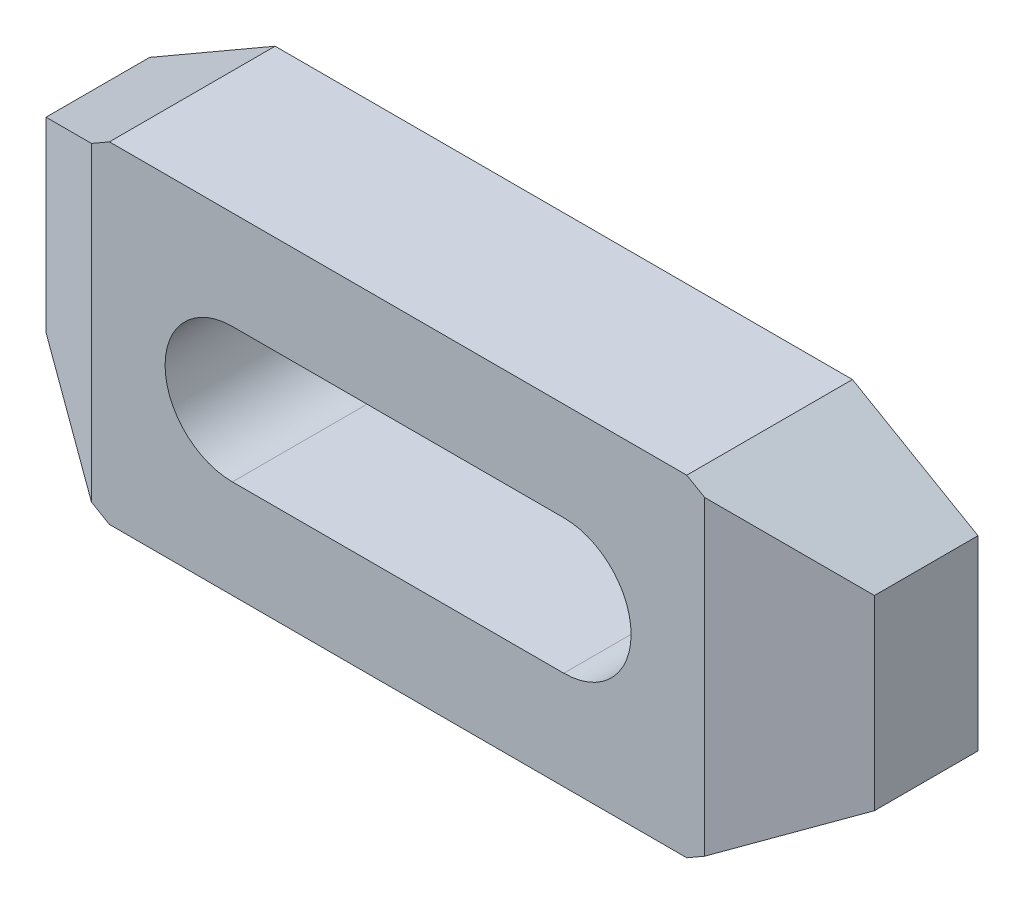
ISO-10303-21;
HEADER;
FILE_DESCRIPTION(('STEP AP214'),'2;1');
FILE_NAME('part.step','',(''),(''),'','','');
FILE_SCHEMA(('AUTOMOTIVE_DESIGN { 1 0 10303 214 1 1 1 1 }'));
ENDSEC;
DATA;
#1=APPLICATION_CONTEXT('core data for automotive mechanical design processes');
#2=APPLICATION_PROTOCOL_DEFINITION('international standard','automotive_design',2000,#1);
#3=PRODUCT_CONTEXT('',#1,'mechanical');
#4=PRODUCT('Part','Part','',(#3));
#5=PRODUCT_RELATED_PRODUCT_CATEGORY('part','',(#4));
#6=PRODUCT_DEFINITION_FORMATION('','',#4);
#7=PRODUCT_DEFINITION_CONTEXT('part definition',#1,'design');
#8=PRODUCT_DEFINITION('design','',#6,#7);
#9=PRODUCT_DEFINITION_SHAPE('','',#8);
#10=(LENGTH_UNIT() NAMED_UNIT(*) SI_UNIT(.MILLI.,.METRE.));
#11=(NAMED_UNIT(*) PLANE_ANGLE_UNIT() SI_UNIT($,.RADIAN.));
#12=(NAMED_UNIT(*) SI_UNIT($,.STERADIAN.) SOLID_ANGLE_UNIT());
#13=UNCERTAINTY_MEASURE_WITH_UNIT(LENGTH_MEASURE(1.E-05),#10,'distance_accuracy_value','');
#14=(GEOMETRIC_REPRESENTATION_CONTEXT(3) GLOBAL_UNCERTAINTY_ASSIGNED_CONTEXT((#13)) GLOBAL_UNIT_ASSIGNED_CONTEXT((#10,
#11,#12)) REPRESENTATION_CONTEXT('',''));
#15=CARTESIAN_POINT('',(0.,0.,0.));
#16=DIRECTION('',(0.,0.,1.));
#17=DIRECTION('',(1.,0.,0.));
#18=AXIS2_PLACEMENT_3D('',#15,#16,#17);
#19=CARTESIAN_POINT('',(0.,-32.0940107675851,16.));
#20=DIRECTION('',(0.,0.,-1.));
#21=DIRECTION('',(-1.,0.,0.));
#22=AXIS2_PLACEMENT_3D('',#19,#20,#21);
#23=PLANE('',#22);
#24=CARTESIAN_POINT('',(16.,0.,16.));
#25=DIRECTION('',(0.,0.,1.));
#26=DIRECTION('',(1.,0.,0.));
#27=AXIS2_PLACEMENT_3D('',#24,#25,#26);
#28=CIRCLE('',#27,6.5);
#29=CARTESIAN_POINT('',(16.,-6.5,16.));
#30=VERTEX_POINT('',#29);
#31=CARTESIAN_POINT('',(16.,6.5,16.));
#32=VERTEX_POINT('',#31);
#33=EDGE_CURVE('E221',#30,#32,#28,.T.);
#34=ORIENTED_EDGE('',*,*,#33,.F.);
#35=DIRECTION('',(-1.,0.,0.));
#36=VECTOR('',#35,1.);
#37=CARTESIAN_POINT('',(16.,-6.5,16.));
#38=LINE('',#37,#36);
#39=CARTESIAN_POINT('',(-16.,-6.5,16.));
#40=VERTEX_POINT('',#39);
#41=EDGE_CURVE('E220',#30,#40,#38,.T.);
#42=ORIENTED_EDGE('',*,*,#41,.T.);
#43=CARTESIAN_POINT('',(-16.,0.,16.));
#44=DIRECTION('',(0.,0.,1.));
#45=DIRECTION('',(1.,0.,0.));
#46=AXIS2_PLACEMENT_3D('',#43,#44,#45);
#47=CIRCLE('',#46,6.5);
#48=CARTESIAN_POINT('',(-16.,6.5,16.));
#49=VERTEX_POINT('',#48);
#50=EDGE_CURVE('E228',#49,#40,#47,.T.);
#51=ORIENTED_EDGE('',*,*,#50,.F.);
#52=DIRECTION('',(-1.,0.,0.));
#53=VECTOR('',#52,1.);
#54=CARTESIAN_POINT('',(16.,6.5,16.));
#55=LINE('',#54,#53);
#56=EDGE_CURVE('E224',#32,#49,#55,.T.);
#57=ORIENTED_EDGE('',*,*,#56,.F.);
#58=EDGE_LOOP('',(#34,#42,#51,#57));
#59=FACE_BOUND('',#58,.T.);
#60=DIRECTION('',(0.,1.,0.));
#61=VECTOR('',#60,1.);
#62=CARTESIAN_POINT('',(-29.6076951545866,-32.0940107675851,16.));
#63=LINE('',#62,#61);
#64=CARTESIAN_POINT('',(-29.6076951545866,-15.,16.));
#65=VERTEX_POINT('',#64);
#66=CARTESIAN_POINT('',(-29.6076951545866,15.,16.));
#67=VERTEX_POINT('',#66);
#68=EDGE_CURVE('E115',#65,#67,#63,.T.);
#69=ORIENTED_EDGE('',*,*,#68,.F.);
#70=DIRECTION('',(-0.866025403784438,0.5,0.));
#71=VECTOR('',#70,1.);
#72=CARTESIAN_POINT('',(-27.8756443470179,-16.,16.));
#73=LINE('',#72,#71);
#74=CARTESIAN_POINT('',(-27.8756443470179,-16.,16.));
#75=VERTEX_POINT('',#74);
#76=EDGE_CURVE('E174',#75,#65,#73,.T.);
#77=ORIENTED_EDGE('',*,*,#76,.F.);
#78=DIRECTION('',(-1.,0.,0.));
#79=VECTOR('',#78,1.);
#80=CARTESIAN_POINT('',(27.8756443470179,-16.,16.));
#81=LINE('',#80,#79);
#82=CARTESIAN_POINT('',(27.8756443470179,-16.,16.));
#83=VERTEX_POINT('',#82);
#84=EDGE_CURVE('E177',#83,#75,#81,.T.);
#85=ORIENTED_EDGE('',*,*,#84,.F.);
#86=DIRECTION('',(-0.866025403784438,-0.5,0.));
#87=VECTOR('',#86,1.);
#88=CARTESIAN_POINT('',(40.,-9.,16.));
#89=LINE('',#88,#87);
#90=CARTESIAN_POINT('',(29.6076951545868,-15.,16.));
#91=VERTEX_POINT('',#90);
#92=EDGE_CURVE('E157',#91,#83,#89,.T.);
#93=ORIENTED_EDGE('',*,*,#92,.F.);
#94=DIRECTION('',(0.,1.,0.));
#95=VECTOR('',#94,1.);
#96=CARTESIAN_POINT('',(29.6076951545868,-32.0940107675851,16.));
#97=LINE('',#96,#95);
#98=CARTESIAN_POINT('',(29.6076951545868,15.,16.));
#99=VERTEX_POINT('',#98);
#100=EDGE_CURVE('E146',#91,#99,#97,.T.);
#101=ORIENTED_EDGE('',*,*,#100,.T.);
#102=DIRECTION('',(0.866025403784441,-0.5,0.));
#103=VECTOR('',#102,1.);
#104=CARTESIAN_POINT('',(27.8756443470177,16.,16.));
#105=LINE('',#104,#103);
#106=CARTESIAN_POINT('',(27.8756443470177,16.,16.));
#107=VERTEX_POINT('',#106);
#108=EDGE_CURVE('E155',#107,#99,#105,.T.);
#109=ORIENTED_EDGE('',*,*,#108,.F.);
#110=DIRECTION('',(1.,0.,0.));
#111=VECTOR('',#110,1.);
#112=CARTESIAN_POINT('',(-27.8756443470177,16.,16.));
#113=LINE('',#112,#111);
#114=CARTESIAN_POINT('',(-27.8756443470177,16.,16.));
#115=VERTEX_POINT('',#114);
#116=EDGE_CURVE('E164',#115,#107,#113,.T.);
#117=ORIENTED_EDGE('',*,*,#116,.F.);
#118=DIRECTION('',(0.866025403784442,0.5,0.));
#119=VECTOR('',#118,1.);
#120=CARTESIAN_POINT('',(-40.,9.,16.));
#121=LINE('',#120,#119);
#122=EDGE_CURVE('E167',#67,#115,#121,.T.);
#123=ORIENTED_EDGE('',*,*,#122,.F.);
#124=EDGE_LOOP('',(#69,#77,#85,#93,#101,#109,#117,#123));
#125=FACE_BOUND('',#124,.T.);
#126=ADVANCED_FACE('F14',(#59,#125),#23,.F.);
#127=CARTESIAN_POINT('',(-40.,9.,16.));
#128=DIRECTION('',(-0.5,0.866025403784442,0.));
#129=DIRECTION('',(-0.866025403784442,-0.5,0.));
#130=AXIS2_PLACEMENT_3D('',#127,#128,#129);
#131=PLANE('',#130);
#132=DIRECTION('',(0.,0.,-1.));
#133=VECTOR('',#132,1.);
#134=CARTESIAN_POINT('',(-40.,9.,16.));
#135=LINE('',#134,#133);
#136=CARTESIAN_POINT('',(-40.,9.,10.));
#137=VERTEX_POINT('',#136);
#138=CARTESIAN_POINT('',(-40.,9.,0.));
#139=VERTEX_POINT('',#138);
#140=EDGE_CURVE('E124',#137,#139,#135,.T.);
#141=ORIENTED_EDGE('',*,*,#140,.F.);
#142=DIRECTION('',(0.774596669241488,0.447213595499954,0.447213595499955));
#143=VECTOR('',#142,1.);
#144=CARTESIAN_POINT('',(-37.9215390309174,10.2,11.2));
#145=LINE('',#144,#143);
#146=EDGE_CURVE('E112',#137,#67,#145,.T.);
#147=ORIENTED_EDGE('',*,*,#146,.T.);
#148=ORIENTED_EDGE('',*,*,#122,.T.);
#149=DIRECTION('',(0.,0.,-1.));
#150=VECTOR('',#149,1.);
#151=CARTESIAN_POINT('',(-27.8756443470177,16.,16.));
#152=LINE('',#151,#150);
#153=CARTESIAN_POINT('',(-27.8756443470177,16.,0.));
#154=VERTEX_POINT('',#153);
#155=EDGE_CURVE('E132',#115,#154,#152,.T.);
#156=ORIENTED_EDGE('',*,*,#155,.T.);
#157=DIRECTION('',(0.866025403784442,0.5,0.));
#158=VECTOR('',#157,1.);
#159=CARTESIAN_POINT('',(-40.,9.,0.));
#160=LINE('',#159,#158);
#161=EDGE_CURVE('E131',#139,#154,#160,.T.);
#162=ORIENTED_EDGE('',*,*,#161,.F.);
#163=EDGE_LOOP('',(#141,#147,#148,#156,#162));
#164=FACE_BOUND('',#163,.T.);
#165=ADVANCED_FACE('F129',(#164),#131,.T.);
#166=CARTESIAN_POINT('',(-40.,-9.,16.));
#167=DIRECTION('',(-1.,0.,0.));
#168=DIRECTION('',(0.,0.,1.));
#169=AXIS2_PLACEMENT_3D('',#166,#167,#168);
#170=PLANE('',#169);
#171=DIRECTION('',(0.,0.,-1.));
#172=VECTOR('',#171,1.);
#173=CARTESIAN_POINT('',(-40.,-9.,16.));
#174=LINE('',#173,#172);
#175=CARTESIAN_POINT('',(-40.,-9.,10.));
#176=VERTEX_POINT('',#175);
#177=CARTESIAN_POINT('',(-40.,-9.,0.));
#178=VERTEX_POINT('',#177);
#179=EDGE_CURVE('E126',#176,#178,#174,.T.);
#180=ORIENTED_EDGE('',*,*,#179,.F.);
#181=DIRECTION('',(0.,1.,0.));
#182=VECTOR('',#181,1.);
#183=CARTESIAN_POINT('',(-40.,-20.,10.));
#184=LINE('',#183,#182);
#185=EDGE_CURVE('E29',#176,#137,#184,.T.);
#186=ORIENTED_EDGE('',*,*,#185,.T.);
#187=ORIENTED_EDGE('',*,*,#140,.T.);
#188=DIRECTION('',(0.,1.,0.));
#189=VECTOR('',#188,1.);
#190=CARTESIAN_POINT('',(-40.,-9.,0.));
#191=LINE('',#190,#189);
#192=EDGE_CURVE('E199',#178,#139,#191,.T.);
#193=ORIENTED_EDGE('',*,*,#192,.F.);
#194=EDGE_LOOP('',(#180,#186,#187,#193));
#195=FACE_BOUND('',#194,.T.);
#196=ADVANCED_FACE('F122',(#195),#170,.T.);
#197=CARTESIAN_POINT('',(-27.8756443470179,-16.,16.));
#198=DIRECTION('',(-0.5,-0.866025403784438,0.));
#199=DIRECTION('',(0.866025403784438,-0.5,0.));
#200=AXIS2_PLACEMENT_3D('',#197,#198,#199);
#201=PLANE('',#200);
#202=ORIENTED_EDGE('',*,*,#76,.T.);
#203=DIRECTION('',(-0.774596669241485,0.447213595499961,-0.447213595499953));
#204=VECTOR('',#203,1.);
#205=CARTESIAN_POINT('',(-28.2220545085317,-15.8,16.8));
#206=LINE('',#205,#204);
#207=EDGE_CURVE('E9',#65,#176,#206,.T.);
#208=ORIENTED_EDGE('',*,*,#207,.T.);
#209=ORIENTED_EDGE('',*,*,#179,.T.);
#210=DIRECTION('',(-0.866025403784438,0.5,0.));
#211=VECTOR('',#210,1.);
#212=CARTESIAN_POINT('',(-27.8756443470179,-16.,0.));
#213=LINE('',#212,#211);
#214=CARTESIAN_POINT('',(-27.8756443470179,-16.,0.));
#215=VERTEX_POINT('',#214);
#216=EDGE_CURVE('E195',#215,#178,#213,.T.);
#217=ORIENTED_EDGE('',*,*,#216,.F.);
#218=DIRECTION('',(0.,0.,-1.));
#219=VECTOR('',#218,1.);
#220=CARTESIAN_POINT('',(-27.8756443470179,-16.,16.));
#221=LINE('',#220,#219);
#222=EDGE_CURVE('E136',#75,#215,#221,.T.);
#223=ORIENTED_EDGE('',*,*,#222,.F.);
#224=EDGE_LOOP('',(#202,#208,#209,#217,#223));
#225=FACE_BOUND('',#224,.T.);
#226=ADVANCED_FACE('F198',(#225),#201,.T.);
#227=CARTESIAN_POINT('',(0.,-32.0940107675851,0.));
#228=DIRECTION('',(0.,0.,-1.));
#229=DIRECTION('',(-1.,0.,0.));
#230=AXIS2_PLACEMENT_3D('',#227,#228,#229);
#231=PLANE('',#230);
#232=DIRECTION('',(-0.866025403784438,-0.5,0.));
#233=VECTOR('',#232,1.);
#234=CARTESIAN_POINT('',(40.,-9.,0.));
#235=LINE('',#234,#233);
#236=CARTESIAN_POINT('',(40.,-9.,0.));
#237=VERTEX_POINT('',#236);
#238=CARTESIAN_POINT('',(27.8756443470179,-16.,0.));
#239=VERTEX_POINT('',#238);
#240=EDGE_CURVE('E170',#237,#239,#235,.T.);
#241=ORIENTED_EDGE('',*,*,#240,.T.);
#242=DIRECTION('',(-1.,0.,0.));
#243=VECTOR('',#242,1.);
#244=CARTESIAN_POINT('',(27.8756443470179,-16.,0.));
#245=LINE('',#244,#243);
#246=EDGE_CURVE('E186',#239,#215,#245,.T.);
#247=ORIENTED_EDGE('',*,*,#246,.T.);
#248=ORIENTED_EDGE('',*,*,#216,.T.);
#249=ORIENTED_EDGE('',*,*,#192,.T.);
#250=ORIENTED_EDGE('',*,*,#161,.T.);
#251=DIRECTION('',(1.,0.,0.));
#252=VECTOR('',#251,1.);
#253=CARTESIAN_POINT('',(-27.8756443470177,16.,0.));
#254=LINE('',#253,#252);
#255=CARTESIAN_POINT('',(27.8756443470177,16.,0.));
#256=VERTEX_POINT('',#255);
#257=EDGE_CURVE('E204',#154,#256,#254,.T.);
#258=ORIENTED_EDGE('',*,*,#257,.T.);
#259=DIRECTION('',(0.866025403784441,-0.5,0.));
#260=VECTOR('',#259,1.);
#261=CARTESIAN_POINT('',(27.8756443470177,16.,0.));
#262=LINE('',#261,#260);
#263=CARTESIAN_POINT('',(40.,9.,0.));
#264=VERTEX_POINT('',#263);
#265=EDGE_CURVE('E207',#256,#264,#262,.T.);
#266=ORIENTED_EDGE('',*,*,#265,.T.);
#267=DIRECTION('',(0.,-1.,0.));
#268=VECTOR('',#267,1.);
#269=CARTESIAN_POINT('',(40.,9.,0.));
#270=LINE('',#269,#268);
#271=EDGE_CURVE('E180',#264,#237,#270,.T.);
#272=ORIENTED_EDGE('',*,*,#271,.T.);
#273=EDGE_LOOP('',(#241,#247,#248,#249,#250,#258,#266,#272));
#274=FACE_BOUND('',#273,.T.);
#275=DIRECTION('',(-1.,0.,0.));
#276=VECTOR('',#275,1.);
#277=CARTESIAN_POINT('',(16.,-6.5,0.));
#278=LINE('',#277,#276);
#279=CARTESIAN_POINT('',(16.,-6.5,0.));
#280=VERTEX_POINT('',#279);
#281=CARTESIAN_POINT('',(-16.,-6.5,0.));
#282=VERTEX_POINT('',#281);
#283=EDGE_CURVE('E225',#280,#282,#278,.T.);
#284=ORIENTED_EDGE('',*,*,#283,.F.);
#285=CARTESIAN_POINT('',(16.,0.,0.));
#286=DIRECTION('',(0.,0.,1.));
#287=DIRECTION('',(1.,0.,0.));
#288=AXIS2_PLACEMENT_3D('',#285,#286,#287);
#289=CIRCLE('',#288,6.5);
#290=CARTESIAN_POINT('',(16.,6.5,0.));
#291=VERTEX_POINT('',#290);
#292=EDGE_CURVE('E232',#280,#291,#289,.T.);
#293=ORIENTED_EDGE('',*,*,#292,.T.);
#294=DIRECTION('',(-1.,0.,0.));
#295=VECTOR('',#294,1.);
#296=CARTESIAN_POINT('',(16.,6.5,0.));
#297=LINE('',#296,#295);
#298=CARTESIAN_POINT('',(-16.,6.5,0.));
#299=VERTEX_POINT('',#298);
#300=EDGE_CURVE('E235',#291,#299,#297,.T.);
#301=ORIENTED_EDGE('',*,*,#300,.T.);
#302=CARTESIAN_POINT('',(-16.,0.,0.));
#303=DIRECTION('',(0.,0.,1.));
#304=DIRECTION('',(1.,0.,0.));
#305=AXIS2_PLACEMENT_3D('',#302,#303,#304);
#306=CIRCLE('',#305,6.5);
#307=EDGE_CURVE('E238',#299,#282,#306,.T.);
#308=ORIENTED_EDGE('',*,*,#307,.T.);
#309=EDGE_LOOP('',(#284,#293,#301,#308));
#310=FACE_BOUND('',#309,.T.);
#311=ADVANCED_FACE('F193',(#274,#310),#231,.T.);
#312=CARTESIAN_POINT('',(40.,-9.,16.));
#313=DIRECTION('',(0.5,-0.866025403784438,0.));
#314=DIRECTION('',(0.866025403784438,0.5,0.));
#315=AXIS2_PLACEMENT_3D('',#312,#313,#314);
#316=PLANE('',#315);
#317=DIRECTION('',(0.774596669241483,0.447213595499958,-0.447213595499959));
#318=VECTOR('',#317,1.);
#319=CARTESIAN_POINT('',(37.9215390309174,-10.2,11.2));
#320=LINE('',#319,#318);
#321=CARTESIAN_POINT('',(40.,-9.,10.));
#322=VERTEX_POINT('',#321);
#323=EDGE_CURVE('E158',#91,#322,#320,.T.);
#324=ORIENTED_EDGE('',*,*,#323,.F.);
#325=ORIENTED_EDGE('',*,*,#92,.T.);
#326=DIRECTION('',(0.,0.,-1.));
#327=VECTOR('',#326,1.);
#328=CARTESIAN_POINT('',(27.8756443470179,-16.,16.));
#329=LINE('',#328,#327);
#330=EDGE_CURVE('E163',#83,#239,#329,.T.);
#331=ORIENTED_EDGE('',*,*,#330,.T.);
#332=ORIENTED_EDGE('',*,*,#240,.F.);
#333=DIRECTION('',(0.,0.,-1.));
#334=VECTOR('',#333,1.);
#335=CARTESIAN_POINT('',(40.,-9.,16.));
#336=LINE('',#335,#334);
#337=EDGE_CURVE('E143',#322,#237,#336,.T.);
#338=ORIENTED_EDGE('',*,*,#337,.F.);
#339=EDGE_LOOP('',(#324,#325,#331,#332,#338));
#340=FACE_BOUND('',#339,.T.);
#341=ADVANCED_FACE('F249',(#340),#316,.T.);
#342=CARTESIAN_POINT('',(40.,9.,16.));
#343=DIRECTION('',(1.,0.,0.));
#344=DIRECTION('',(0.,1.,0.));
#345=AXIS2_PLACEMENT_3D('',#342,#343,#344);
#346=PLANE('',#345);
#347=DIRECTION('',(0.,1.,0.));
#348=VECTOR('',#347,1.);
#349=CARTESIAN_POINT('',(40.,-20.,10.));
#350=LINE('',#349,#348);
#351=CARTESIAN_POINT('',(40.,9.,10.));
#352=VERTEX_POINT('',#351);
#353=EDGE_CURVE('E36',#322,#352,#350,.T.);
#354=ORIENTED_EDGE('',*,*,#353,.F.);
#355=ORIENTED_EDGE('',*,*,#337,.T.);
#356=ORIENTED_EDGE('',*,*,#271,.F.);
#357=DIRECTION('',(0.,0.,-1.));
#358=VECTOR('',#357,1.);
#359=CARTESIAN_POINT('',(40.,9.,16.));
#360=LINE('',#359,#358);
#361=EDGE_CURVE('E141',#352,#264,#360,.T.);
#362=ORIENTED_EDGE('',*,*,#361,.F.);
#363=EDGE_LOOP('',(#354,#355,#356,#362));
#364=FACE_BOUND('',#363,.T.);
#365=ADVANCED_FACE('F16',(#364),#346,.T.);
#366=CARTESIAN_POINT('',(27.8756443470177,16.,16.));
#367=DIRECTION('',(0.5,0.866025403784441,0.));
#368=DIRECTION('',(-0.866025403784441,0.5,0.));
#369=AXIS2_PLACEMENT_3D('',#366,#367,#368);
#370=PLANE('',#369);
#371=DIRECTION('',(-0.774596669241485,0.447213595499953,0.44721359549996));
#372=VECTOR('',#371,1.);
#373=CARTESIAN_POINT('',(28.2220545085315,15.8,16.8));
#374=LINE('',#373,#372);
#375=EDGE_CURVE('E22',#352,#99,#374,.T.);
#376=ORIENTED_EDGE('',*,*,#375,.F.);
#377=ORIENTED_EDGE('',*,*,#361,.T.);
#378=ORIENTED_EDGE('',*,*,#265,.F.);
#379=DIRECTION('',(0.,0.,-1.));
#380=VECTOR('',#379,1.);
#381=CARTESIAN_POINT('',(27.8756443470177,16.,16.));
#382=LINE('',#381,#380);
#383=EDGE_CURVE('E134',#107,#256,#382,.T.);
#384=ORIENTED_EDGE('',*,*,#383,.F.);
#385=ORIENTED_EDGE('',*,*,#108,.T.);
#386=EDGE_LOOP('',(#376,#377,#378,#384,#385));
#387=FACE_BOUND('',#386,.T.);
#388=ADVANCED_FACE('F160',(#387),#370,.T.);
#389=CARTESIAN_POINT('',(-27.8756443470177,16.,16.));
#390=DIRECTION('',(0.,1.,0.));
#391=DIRECTION('',(0.,0.,1.));
#392=AXIS2_PLACEMENT_3D('',#389,#390,#391);
#393=PLANE('',#392);
#394=ORIENTED_EDGE('',*,*,#155,.F.);
#395=ORIENTED_EDGE('',*,*,#116,.T.);
#396=ORIENTED_EDGE('',*,*,#383,.T.);
#397=ORIENTED_EDGE('',*,*,#257,.F.);
#398=EDGE_LOOP('',(#394,#395,#396,#397));
#399=FACE_BOUND('',#398,.T.);
#400=ADVANCED_FACE('F253',(#399),#393,.T.);
#401=CARTESIAN_POINT('',(27.8756443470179,-16.,16.));
#402=DIRECTION('',(0.,-1.,0.));
#403=DIRECTION('',(1.,0.,0.));
#404=AXIS2_PLACEMENT_3D('',#401,#402,#403);
#405=PLANE('',#404);
#406=ORIENTED_EDGE('',*,*,#84,.T.);
#407=ORIENTED_EDGE('',*,*,#222,.T.);
#408=ORIENTED_EDGE('',*,*,#246,.F.);
#409=ORIENTED_EDGE('',*,*,#330,.F.);
#410=EDGE_LOOP('',(#406,#407,#408,#409));
#411=FACE_BOUND('',#410,.T.);
#412=ADVANCED_FACE('F184',(#411),#405,.T.);
#413=CARTESIAN_POINT('',(16.,0.,16.));
#414=DIRECTION('',(0.,0.,-1.));
#415=DIRECTION('',(-1.,0.,0.));
#416=AXIS2_PLACEMENT_3D('',#413,#414,#415);
#417=CYLINDRICAL_SURFACE('',#416,6.5);
#418=DIRECTION('',(0.,0.,-1.));
#419=VECTOR('',#418,1.);
#420=CARTESIAN_POINT('',(16.,6.5,16.));
#421=LINE('',#420,#419);
#422=EDGE_CURVE('E211',#32,#291,#421,.T.);
#423=ORIENTED_EDGE('',*,*,#422,.T.);
#424=ORIENTED_EDGE('',*,*,#292,.F.);
#425=DIRECTION('',(0.,0.,-1.));
#426=VECTOR('',#425,1.);
#427=CARTESIAN_POINT('',(16.,-6.5,16.));
#428=LINE('',#427,#426);
#429=EDGE_CURVE('E217',#30,#280,#428,.T.);
#430=ORIENTED_EDGE('',*,*,#429,.F.);
#431=ORIENTED_EDGE('',*,*,#33,.T.);
#432=EDGE_LOOP('',(#423,#424,#430,#431));
#433=FACE_BOUND('',#432,.T.);
#434=ADVANCED_FACE('F261',(#433),#417,.F.);
#435=CARTESIAN_POINT('',(16.,6.5,16.));
#436=DIRECTION('',(0.,-1.,0.));
#437=DIRECTION('',(1.,0.,0.));
#438=AXIS2_PLACEMENT_3D('',#435,#436,#437);
#439=PLANE('',#438);
#440=DIRECTION('',(0.,0.,-1.));
#441=VECTOR('',#440,1.);
#442=CARTESIAN_POINT('',(-16.,6.5,16.));
#443=LINE('',#442,#441);
#444=EDGE_CURVE('E213',#49,#299,#443,.T.);
#445=ORIENTED_EDGE('',*,*,#444,.T.);
#446=ORIENTED_EDGE('',*,*,#300,.F.);
#447=ORIENTED_EDGE('',*,*,#422,.F.);
#448=ORIENTED_EDGE('',*,*,#56,.T.);
#449=EDGE_LOOP('',(#445,#446,#447,#448));
#450=FACE_BOUND('',#449,.T.);
#451=ADVANCED_FACE('F336',(#450),#439,.T.);
#452=CARTESIAN_POINT('',(-16.,0.,16.));
#453=DIRECTION('',(0.,0.,-1.));
#454=DIRECTION('',(-1.,0.,0.));
#455=AXIS2_PLACEMENT_3D('',#452,#453,#454);
#456=CYLINDRICAL_SURFACE('',#455,6.5);
#457=DIRECTION('',(0.,0.,-1.));
#458=VECTOR('',#457,1.);
#459=CARTESIAN_POINT('',(-16.,-6.5,16.));
#460=LINE('',#459,#458);
#461=EDGE_CURVE('E215',#40,#282,#460,.T.);
#462=ORIENTED_EDGE('',*,*,#461,.T.);
#463=ORIENTED_EDGE('',*,*,#307,.F.);
#464=ORIENTED_EDGE('',*,*,#444,.F.);
#465=ORIENTED_EDGE('',*,*,#50,.T.);
#466=EDGE_LOOP('',(#462,#463,#464,#465));
#467=FACE_BOUND('',#466,.T.);
#468=ADVANCED_FACE('F346',(#467),#456,.F.);
#469=CARTESIAN_POINT('',(16.,-6.5,16.));
#470=DIRECTION('',(0.,-1.,0.));
#471=DIRECTION('',(1.,0.,0.));
#472=AXIS2_PLACEMENT_3D('',#469,#470,#471);
#473=PLANE('',#472);
#474=ORIENTED_EDGE('',*,*,#41,.F.);
#475=ORIENTED_EDGE('',*,*,#429,.T.);
#476=ORIENTED_EDGE('',*,*,#283,.T.);
#477=ORIENTED_EDGE('',*,*,#461,.F.);
#478=EDGE_LOOP('',(#474,#475,#476,#477));
#479=FACE_BOUND('',#478,.T.);
#480=ADVANCED_FACE('F355',(#479),#473,.F.);
#481=CARTESIAN_POINT('',(40.,-20.,10.));
#482=DIRECTION('',(-0.5,0.,-0.866025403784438));
#483=DIRECTION('',(-0.866025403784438,0.,0.5));
#484=AXIS2_PLACEMENT_3D('',#481,#482,#483);
#485=PLANE('',#484);
#486=ORIENTED_EDGE('',*,*,#323,.T.);
#487=ORIENTED_EDGE('',*,*,#353,.T.);
#488=ORIENTED_EDGE('',*,*,#375,.T.);
#489=ORIENTED_EDGE('',*,*,#100,.F.);
#490=EDGE_LOOP('',(#486,#487,#488,#489));
#491=FACE_BOUND('',#490,.T.);
#492=ADVANCED_FACE('F145',(#491),#485,.F.);
#493=CARTESIAN_POINT('',(-40.,-20.,10.));
#494=DIRECTION('',(-0.5,0.,0.866025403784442));
#495=DIRECTION('',(0.866025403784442,0.,0.5));
#496=AXIS2_PLACEMENT_3D('',#493,#494,#495);
#497=PLANE('',#496);
#498=ORIENTED_EDGE('',*,*,#185,.F.);
#499=ORIENTED_EDGE('',*,*,#207,.F.);
#500=ORIENTED_EDGE('',*,*,#68,.T.);
#501=ORIENTED_EDGE('',*,*,#146,.F.);
#502=EDGE_LOOP('',(#498,#499,#500,#501));
#503=FACE_BOUND('',#502,.T.);
#504=ADVANCED_FACE('F113',(#503),#497,.T.);
#505=CLOSED_SHELL('',(#126,#165,#196,#226,#311,#341,#365,#388,#400,#412,#434,#451,#468,#480,
#492,#504));
#506=MANIFOLD_SOLID_BREP('B1',#505);
#507=ADVANCED_BREP_SHAPE_REPRESENTATION('',(#18,#506),#14);
#508=SHAPE_DEFINITION_REPRESENTATION(#9,#507);
ENDSEC;
END-ISO-10303-21;
